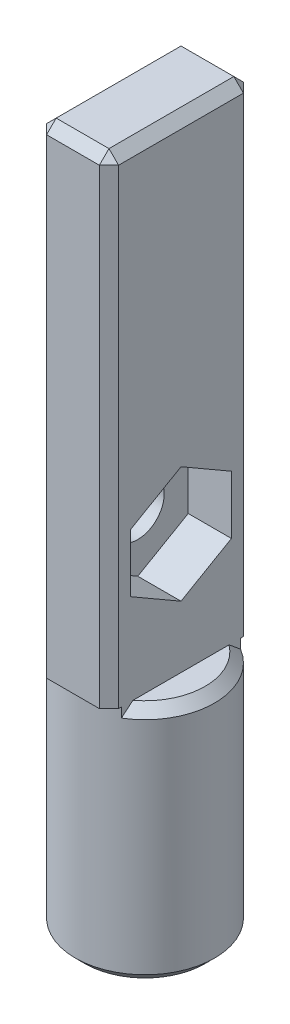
ISO-10303-21;
HEADER;
FILE_DESCRIPTION(('STEP AP214'),'2;1');
FILE_NAME('part.step','',(''),(''),'','','');
FILE_SCHEMA(('AUTOMOTIVE_DESIGN { 1 0 10303 214 1 1 1 1 }'));
ENDSEC;
DATA;
#1=APPLICATION_CONTEXT('core data for automotive mechanical design processes');
#2=APPLICATION_PROTOCOL_DEFINITION('international standard','automotive_design',2000,#1);
#3=PRODUCT_CONTEXT('',#1,'mechanical');
#4=PRODUCT('Part','Part','',(#3));
#5=PRODUCT_RELATED_PRODUCT_CATEGORY('part','',(#4));
#6=PRODUCT_DEFINITION_FORMATION('','',#4);
#7=PRODUCT_DEFINITION_CONTEXT('part definition',#1,'design');
#8=PRODUCT_DEFINITION('design','',#6,#7);
#9=PRODUCT_DEFINITION_SHAPE('','',#8);
#10=(LENGTH_UNIT() NAMED_UNIT(*) SI_UNIT(.MILLI.,.METRE.));
#11=(NAMED_UNIT(*) PLANE_ANGLE_UNIT() SI_UNIT($,.RADIAN.));
#12=(NAMED_UNIT(*) SI_UNIT($,.STERADIAN.) SOLID_ANGLE_UNIT());
#13=UNCERTAINTY_MEASURE_WITH_UNIT(LENGTH_MEASURE(1.E-05),#10,'distance_accuracy_value','');
#14=(GEOMETRIC_REPRESENTATION_CONTEXT(3) GLOBAL_UNCERTAINTY_ASSIGNED_CONTEXT((#13)) GLOBAL_UNIT_ASSIGNED_CONTEXT((#10,
#11,#12)) REPRESENTATION_CONTEXT('',''));
#15=CARTESIAN_POINT('',(0.,0.,0.));
#16=DIRECTION('',(0.,0.,1.));
#17=DIRECTION('',(1.,0.,0.));
#18=AXIS2_PLACEMENT_3D('',#15,#16,#17);
#19=CARTESIAN_POINT('',(0.,10.,0.));
#20=DIRECTION('',(0.,1.,0.));
#21=DIRECTION('',(0.,0.,1.));
#22=AXIS2_PLACEMENT_3D('',#19,#20,#21);
#23=PLANE('',#22);
#24=DIRECTION('',(0.,0.,1.));
#25=VECTOR('',#24,1.);
#26=CARTESIAN_POINT('',(-1.5,10.,3.));
#27=LINE('',#26,#25);
#28=CARTESIAN_POINT('',(-1.5,10.,-2.00000000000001));
#29=VERTEX_POINT('',#28);
#30=CARTESIAN_POINT('',(-1.5,10.,2.00000000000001));
#31=VERTEX_POINT('',#30);
#32=EDGE_CURVE('E283',#29,#31,#27,.T.);
#33=ORIENTED_EDGE('',*,*,#32,.F.);
#34=CARTESIAN_POINT('',(0.,10.,0.));
#35=DIRECTION('',(0.,1.,0.));
#36=DIRECTION('',(0.,0.,1.));
#37=AXIS2_PLACEMENT_3D('',#34,#35,#36);
#38=CIRCLE('',#37,2.50000000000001);
#39=EDGE_CURVE('E448',#29,#31,#38,.T.);
#40=ORIENTED_EDGE('',*,*,#39,.T.);
#41=EDGE_LOOP('',(#33,#40));
#42=FACE_BOUND('',#41,.T.);
#43=ADVANCED_FACE('F41',(#42),#23,.T.);
#44=CARTESIAN_POINT('',(0.,10.,0.));
#45=DIRECTION('',(0.,-1.,0.));
#46=DIRECTION('',(0.,0.,-1.));
#47=AXIS2_PLACEMENT_3D('',#44,#45,#46);
#48=CYLINDRICAL_SURFACE('',#47,2.9);
#49=CARTESIAN_POINT('',(0.,0.400000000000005,0.));
#50=DIRECTION('',(0.,1.,0.));
#51=DIRECTION('',(0.,0.,1.));
#52=AXIS2_PLACEMENT_3D('',#49,#50,#51);
#53=CIRCLE('',#52,2.9);
#54=CARTESIAN_POINT('',(0.,0.400000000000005,2.9));
#55=VERTEX_POINT('',#54);
#56=EDGE_CURVE('E426',#55,#55,#53,.T.);
#57=ORIENTED_EDGE('',*,*,#56,.T.);
#58=EDGE_LOOP('',(#57));
#59=FACE_BOUND('',#58,.T.);
#60=CARTESIAN_POINT('',(0.,10.,0.));
#61=DIRECTION('',(0.,1.,0.));
#62=DIRECTION('',(0.,0.,1.));
#63=AXIS2_PLACEMENT_3D('',#60,#61,#62);
#64=CIRCLE('',#63,2.9);
#65=CARTESIAN_POINT('',(1.5,10.,-2.48193472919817));
#66=VERTEX_POINT('',#65);
#67=CARTESIAN_POINT('',(-1.5,10.,-2.48193472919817));
#68=VERTEX_POINT('',#67);
#69=EDGE_CURVE('E309',#66,#68,#64,.T.);
#70=ORIENTED_EDGE('',*,*,#69,.F.);
#71=DIRECTION('',(0.,-1.,0.));
#72=VECTOR('',#71,1.);
#73=CARTESIAN_POINT('',(1.5,10.,-2.48193472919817));
#74=LINE('',#73,#72);
#75=CARTESIAN_POINT('',(1.5,9.60000000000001,-2.48193472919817));
#76=VERTEX_POINT('',#75);
#77=EDGE_CURVE('E71',#66,#76,#74,.T.);
#78=ORIENTED_EDGE('',*,*,#77,.T.);
#79=CARTESIAN_POINT('',(0.,9.60000000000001,0.));
#80=DIRECTION('',(0.,1.,0.));
#81=DIRECTION('',(0.,0.,1.));
#82=AXIS2_PLACEMENT_3D('',#79,#80,#81);
#83=CIRCLE('',#82,2.9);
#84=CARTESIAN_POINT('',(1.5,9.60000000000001,2.48193472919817));
#85=VERTEX_POINT('',#84);
#86=EDGE_CURVE('E442',#76,#85,#83,.F.);
#87=ORIENTED_EDGE('',*,*,#86,.T.);
#88=DIRECTION('',(0.,-1.,0.));
#89=VECTOR('',#88,1.);
#90=CARTESIAN_POINT('',(1.5,9.60000000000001,2.48193472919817));
#91=LINE('',#90,#89);
#92=CARTESIAN_POINT('',(1.5,10.,2.48193472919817));
#93=VERTEX_POINT('',#92);
#94=EDGE_CURVE('E439',#85,#93,#91,.F.);
#95=ORIENTED_EDGE('',*,*,#94,.T.);
#96=CARTESIAN_POINT('',(-1.5,10.,2.48193472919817));
#97=VERTEX_POINT('',#96);
#98=EDGE_CURVE('E302',#97,#93,#64,.T.);
#99=ORIENTED_EDGE('',*,*,#98,.F.);
#100=DIRECTION('',(0.,-1.,0.));
#101=VECTOR('',#100,1.);
#102=CARTESIAN_POINT('',(-1.5,10.,2.48193472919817));
#103=LINE('',#102,#101);
#104=CARTESIAN_POINT('',(-1.5,9.60000000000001,2.48193472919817));
#105=VERTEX_POINT('',#104);
#106=EDGE_CURVE('E63',#97,#105,#103,.T.);
#107=ORIENTED_EDGE('',*,*,#106,.T.);
#108=CARTESIAN_POINT('',(0.,9.60000000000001,0.));
#109=DIRECTION('',(0.,1.,0.));
#110=DIRECTION('',(0.,0.,1.));
#111=AXIS2_PLACEMENT_3D('',#108,#109,#110);
#112=CIRCLE('',#111,2.9);
#113=CARTESIAN_POINT('',(-1.5,9.60000000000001,-2.48193472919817));
#114=VERTEX_POINT('',#113);
#115=EDGE_CURVE('E433',#105,#114,#112,.F.);
#116=ORIENTED_EDGE('',*,*,#115,.T.);
#117=DIRECTION('',(0.,-1.,0.));
#118=VECTOR('',#117,1.);
#119=CARTESIAN_POINT('',(-1.5,9.60000000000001,-2.48193472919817));
#120=LINE('',#119,#118);
#121=EDGE_CURVE('E430',#114,#68,#120,.F.);
#122=ORIENTED_EDGE('',*,*,#121,.T.);
#123=EDGE_LOOP('',(#70,#78,#87,#95,#99,#107,#116,#122));
#124=FACE_BOUND('',#123,.T.);
#125=ADVANCED_FACE('F521',(#59,#124),#48,.T.);
#126=DIRECTION('',(0.,0.,-1.));
#127=VECTOR('',#126,1.);
#128=CARTESIAN_POINT('',(1.5,10.,3.));
#129=LINE('',#128,#127);
#130=CARTESIAN_POINT('',(1.5,10.,2.00000000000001));
#131=VERTEX_POINT('',#130);
#132=CARTESIAN_POINT('',(1.5,10.,-2.00000000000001));
#133=VERTEX_POINT('',#132);
#134=EDGE_CURVE('E293',#131,#133,#129,.T.);
#135=ORIENTED_EDGE('',*,*,#134,.F.);
#136=CARTESIAN_POINT('',(0.,10.,0.));
#137=DIRECTION('',(0.,1.,0.));
#138=DIRECTION('',(0.,0.,1.));
#139=AXIS2_PLACEMENT_3D('',#136,#137,#138);
#140=CIRCLE('',#139,2.50000000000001);
#141=EDGE_CURVE('E372',#131,#133,#140,.T.);
#142=ORIENTED_EDGE('',*,*,#141,.T.);
#143=EDGE_LOOP('',(#135,#142));
#144=FACE_BOUND('',#143,.T.);
#145=ADVANCED_FACE('F518',(#144),#23,.T.);
#146=CARTESIAN_POINT('',(0.,0.,0.));
#147=DIRECTION('',(0.,1.,0.));
#148=DIRECTION('',(0.,0.,1.));
#149=AXIS2_PLACEMENT_3D('',#146,#147,#148);
#150=PLANE('',#149);
#151=CARTESIAN_POINT('',(0.,0.,0.));
#152=DIRECTION('',(0.,1.,0.));
#153=DIRECTION('',(0.,0.,1.));
#154=AXIS2_PLACEMENT_3D('',#151,#152,#153);
#155=CIRCLE('',#154,2.49999999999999);
#156=CARTESIAN_POINT('',(0.,0.,2.49999999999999));
#157=VERTEX_POINT('',#156);
#158=EDGE_CURVE('E452',#157,#157,#155,.F.);
#159=ORIENTED_EDGE('',*,*,#158,.T.);
#160=EDGE_LOOP('',(#159));
#161=FACE_BOUND('',#160,.T.);
#162=CARTESIAN_POINT('',(0.,0.,0.));
#163=DIRECTION('',(0.,-1.,0.));
#164=DIRECTION('',(0.,0.,-1.));
#165=AXIS2_PLACEMENT_3D('',#162,#163,#164);
#166=CIRCLE('',#165,2.1);
#167=CARTESIAN_POINT('',(0.,0.,-2.1));
#168=VERTEX_POINT('',#167);
#169=EDGE_CURVE('E297',#168,#168,#166,.T.);
#170=ORIENTED_EDGE('',*,*,#169,.F.);
#171=EDGE_LOOP('',(#170));
#172=FACE_BOUND('',#171,.T.);
#173=ADVANCED_FACE('F516',(#161,#172),#150,.F.);
#174=CARTESIAN_POINT('',(0.,8.,0.));
#175=DIRECTION('',(0.,-1.,0.));
#176=DIRECTION('',(0.,0.,-1.));
#177=AXIS2_PLACEMENT_3D('',#174,#175,#176);
#178=CYLINDRICAL_SURFACE('',#177,2.1);
#179=CARTESIAN_POINT('',(0.,8.,0.));
#180=DIRECTION('',(0.,-1.,0.));
#181=DIRECTION('',(0.,0.,-1.));
#182=AXIS2_PLACEMENT_3D('',#179,#180,#181);
#183=CIRCLE('',#182,2.1);
#184=CARTESIAN_POINT('',(0.,8.,-2.1));
#185=VERTEX_POINT('',#184);
#186=EDGE_CURVE('E298',#185,#185,#183,.T.);
#187=ORIENTED_EDGE('',*,*,#186,.F.);
#188=EDGE_LOOP('',(#187));
#189=FACE_BOUND('',#188,.T.);
#190=ORIENTED_EDGE('',*,*,#169,.T.);
#191=EDGE_LOOP('',(#190));
#192=FACE_BOUND('',#191,.T.);
#193=ADVANCED_FACE('F512',(#189,#192),#178,.F.);
#194=CARTESIAN_POINT('',(0.,8.,0.));
#195=DIRECTION('',(0.,-1.,0.));
#196=DIRECTION('',(0.,0.,-1.));
#197=AXIS2_PLACEMENT_3D('',#194,#195,#196);
#198=PLANE('',#197);
#199=ORIENTED_EDGE('',*,*,#186,.T.);
#200=EDGE_LOOP('',(#199));
#201=FACE_BOUND('',#200,.T.);
#202=ADVANCED_FACE('F508',(#201),#198,.T.);
#203=CARTESIAN_POINT('',(0.,10.,0.));
#204=DIRECTION('',(0.,-1.,0.));
#205=DIRECTION('',(0.,0.,-1.));
#206=AXIS2_PLACEMENT_3D('',#203,#204,#205);
#207=PLANE('',#206);
#208=DIRECTION('',(-1.,0.,0.));
#209=VECTOR('',#208,1.);
#210=CARTESIAN_POINT('',(-1.5,10.,-3.));
#211=LINE('',#210,#209);
#212=CARTESIAN_POINT('',(1.1,10.,-3.));
#213=VERTEX_POINT('',#212);
#214=CARTESIAN_POINT('',(-1.1,10.,-3.));
#215=VERTEX_POINT('',#214);
#216=EDGE_CURVE('E292',#213,#215,#211,.T.);
#217=ORIENTED_EDGE('',*,*,#216,.F.);
#218=DIRECTION('',(-0.707106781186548,0.,-0.707106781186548));
#219=VECTOR('',#218,1.);
#220=CARTESIAN_POINT('',(2.05,10.,-2.05));
#221=LINE('',#220,#219);
#222=CARTESIAN_POINT('',(1.5,10.,-2.6));
#223=VERTEX_POINT('',#222);
#224=EDGE_CURVE('E369',#213,#223,#221,.F.);
#225=ORIENTED_EDGE('',*,*,#224,.T.);
#226=EDGE_CURVE('E287',#66,#223,#129,.T.);
#227=ORIENTED_EDGE('',*,*,#226,.F.);
#228=ORIENTED_EDGE('',*,*,#69,.T.);
#229=CARTESIAN_POINT('',(-1.5,10.,-2.6));
#230=VERTEX_POINT('',#229);
#231=EDGE_CURVE('E277',#230,#68,#27,.T.);
#232=ORIENTED_EDGE('',*,*,#231,.F.);
#233=DIRECTION('',(-0.707106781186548,0.,0.707106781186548));
#234=VECTOR('',#233,1.);
#235=CARTESIAN_POINT('',(-2.05,10.,-2.05));
#236=LINE('',#235,#234);
#237=EDGE_CURVE('E366',#230,#215,#236,.F.);
#238=ORIENTED_EDGE('',*,*,#237,.T.);
#239=EDGE_LOOP('',(#217,#225,#227,#228,#232,#238));
#240=FACE_BOUND('',#239,.T.);
#241=ADVANCED_FACE('F506',(#240),#207,.T.);
#242=CARTESIAN_POINT('',(-1.5,30.,3.));
#243=DIRECTION('',(1.,0.,0.));
#244=DIRECTION('',(0.,0.,-1.));
#245=AXIS2_PLACEMENT_3D('',#242,#243,#244);
#246=PLANE('',#245);
#247=CARTESIAN_POINT('',(-1.5,15.,0.));
#248=DIRECTION('',(1.,0.,0.));
#249=DIRECTION('',(0.,0.,-1.));
#250=AXIS2_PLACEMENT_3D('',#247,#248,#249);
#251=CIRCLE('',#250,1.1);
#252=CARTESIAN_POINT('',(-1.5,15.,-1.1));
#253=VERTEX_POINT('',#252);
#254=EDGE_CURVE('E233',#253,#253,#251,.T.);
#255=ORIENTED_EDGE('',*,*,#254,.T.);
#256=EDGE_LOOP('',(#255));
#257=FACE_BOUND('',#256,.T.);
#258=CARTESIAN_POINT('',(-1.5,10.,2.6));
#259=VERTEX_POINT('',#258);
#260=EDGE_CURVE('E282',#97,#259,#27,.T.);
#261=ORIENTED_EDGE('',*,*,#260,.T.);
#262=DIRECTION('',(0.,1.,0.));
#263=VECTOR('',#262,1.);
#264=CARTESIAN_POINT('',(-1.5,30.,2.6));
#265=LINE('',#264,#263);
#266=CARTESIAN_POINT('',(-1.5,29.6,2.6));
#267=VERTEX_POINT('',#266);
#268=EDGE_CURVE('E341',#259,#267,#265,.T.);
#269=ORIENTED_EDGE('',*,*,#268,.T.);
#270=DIRECTION('',(0.,0.,-1.));
#271=VECTOR('',#270,1.);
#272=CARTESIAN_POINT('',(-1.5,29.6,3.));
#273=LINE('',#272,#271);
#274=CARTESIAN_POINT('',(-1.5,29.6,-2.6));
#275=VERTEX_POINT('',#274);
#276=EDGE_CURVE('E338',#267,#275,#273,.T.);
#277=ORIENTED_EDGE('',*,*,#276,.T.);
#278=DIRECTION('',(0.,-1.,0.));
#279=VECTOR('',#278,1.);
#280=CARTESIAN_POINT('',(-1.5,30.,-2.6));
#281=LINE('',#280,#279);
#282=EDGE_CURVE('E335',#275,#230,#281,.T.);
#283=ORIENTED_EDGE('',*,*,#282,.T.);
#284=ORIENTED_EDGE('',*,*,#231,.T.);
#285=ORIENTED_EDGE('',*,*,#121,.F.);
#286=CARTESIAN_POINT('',(-1.5,9.60000000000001,-2.48193472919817));
#287=CARTESIAN_POINT('',(-1.5,9.63393784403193,-2.4422783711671));
#288=CARTESIAN_POINT('',(-1.5,9.66775216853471,-2.40251586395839));
#289=CARTESIAN_POINT('',(-1.5,9.73509198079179,-2.32275170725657));
#290=CARTESIAN_POINT('',(-1.5,9.76861748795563,-2.28275007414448));
#291=CARTESIAN_POINT('',(-1.5,9.83534295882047,-2.20247487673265));
#292=CARTESIAN_POINT('',(-1.5,9.86854291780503,-2.16220130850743));
#293=CARTESIAN_POINT('',(-1.5,9.93456697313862,-2.08134282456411));
#294=CARTESIAN_POINT('',(-1.5,9.96739104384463,-2.0407578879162));
#295=CARTESIAN_POINT('',(-1.5,10.0000000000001,-2.00000000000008));
#296=B_SPLINE_CURVE_WITH_KNOTS('',3,(#286,#287,#288,#289,#290,#291,#292,#293,#294,#295),
.UNSPECIFIED.,.F.,.F.,(4,2,2,2,4),(0.,0.156587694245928,0.313164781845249,0.469744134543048,
0.626334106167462),.UNSPECIFIED.);
#297=EDGE_CURVE('E11',#114,#29,#296,.T.);
#298=ORIENTED_EDGE('',*,*,#297,.T.);
#299=ORIENTED_EDGE('',*,*,#32,.T.);
#300=CARTESIAN_POINT('',(-1.5,10.,2.00000000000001));
#301=CARTESIAN_POINT('',(-1.5,9.9673910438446,2.04075788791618));
#302=CARTESIAN_POINT('',(-1.5,9.93456697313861,2.0813428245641));
#303=CARTESIAN_POINT('',(-1.5,9.86854291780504,2.16220130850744));
#304=CARTESIAN_POINT('',(-1.5,9.83534295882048,2.20247487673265));
#305=CARTESIAN_POINT('',(-1.5,9.76861748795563,2.28275007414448));
#306=CARTESIAN_POINT('',(-1.5,9.73509198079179,2.32275170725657));
#307=CARTESIAN_POINT('',(-1.5,9.66775216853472,2.40251586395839));
#308=CARTESIAN_POINT('',(-1.5,9.63393784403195,2.44227837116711));
#309=CARTESIAN_POINT('',(-1.5,9.60000000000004,2.4819347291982));
#310=B_SPLINE_CURVE_WITH_KNOTS('',3,(#300,#301,#302,#303,#304,#305,#306,#307,#308,#309),
.UNSPECIFIED.,.F.,.F.,(4,2,2,2,4),(0.,0.156589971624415,0.313169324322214,0.469746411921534,
0.626334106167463),.UNSPECIFIED.);
#311=EDGE_CURVE('E56',#31,#105,#310,.T.);
#312=ORIENTED_EDGE('',*,*,#311,.T.);
#313=ORIENTED_EDGE('',*,*,#106,.F.);
#314=EDGE_LOOP('',(#261,#269,#277,#283,#284,#285,#298,#299,#312,#313));
#315=FACE_BOUND('',#314,.T.);
#316=ADVANCED_FACE('F501',(#257,#315),#246,.F.);
#317=CARTESIAN_POINT('',(-1.5,30.,3.));
#318=DIRECTION('',(0.,0.,-1.));
#319=DIRECTION('',(-1.,0.,0.));
#320=AXIS2_PLACEMENT_3D('',#317,#318,#319);
#321=PLANE('',#320);
#322=DIRECTION('',(1.,0.,0.));
#323=VECTOR('',#322,1.);
#324=CARTESIAN_POINT('',(-1.5,10.,3.));
#325=LINE('',#324,#323);
#326=CARTESIAN_POINT('',(-1.1,10.,3.));
#327=VERTEX_POINT('',#326);
#328=CARTESIAN_POINT('',(1.1,10.,3.));
#329=VERTEX_POINT('',#328);
#330=EDGE_CURVE('E281',#327,#329,#325,.T.);
#331=ORIENTED_EDGE('',*,*,#330,.T.);
#332=DIRECTION('',(0.,1.,0.));
#333=VECTOR('',#332,1.);
#334=CARTESIAN_POINT('',(1.1,30.,3.));
#335=LINE('',#334,#333);
#336=CARTESIAN_POINT('',(1.1,29.6,3.));
#337=VERTEX_POINT('',#336);
#338=EDGE_CURVE('E332',#329,#337,#335,.T.);
#339=ORIENTED_EDGE('',*,*,#338,.T.);
#340=DIRECTION('',(-1.,0.,0.));
#341=VECTOR('',#340,1.);
#342=CARTESIAN_POINT('',(-1.5,29.6,3.));
#343=LINE('',#342,#341);
#344=CARTESIAN_POINT('',(-1.1,29.6,3.));
#345=VERTEX_POINT('',#344);
#346=EDGE_CURVE('E326',#337,#345,#343,.T.);
#347=ORIENTED_EDGE('',*,*,#346,.T.);
#348=DIRECTION('',(0.,-1.,0.));
#349=VECTOR('',#348,1.);
#350=CARTESIAN_POINT('',(-1.1,30.,3.));
#351=LINE('',#350,#349);
#352=EDGE_CURVE('E329',#345,#327,#351,.T.);
#353=ORIENTED_EDGE('',*,*,#352,.T.);
#354=EDGE_LOOP('',(#331,#339,#347,#353));
#355=FACE_BOUND('',#354,.T.);
#356=ADVANCED_FACE('F505',(#355),#321,.F.);
#357=CARTESIAN_POINT('',(1.5,30.,3.));
#358=DIRECTION('',(-1.,0.,0.));
#359=DIRECTION('',(0.,0.,1.));
#360=AXIS2_PLACEMENT_3D('',#357,#358,#359);
#361=PLANE('',#360);
#362=DIRECTION('',(0.,0.500000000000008,-0.866025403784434));
#363=VECTOR('',#362,1.);
#364=CARTESIAN_POINT('',(1.5,13.7875644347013,-2.10000000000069));
#365=LINE('',#364,#363);
#366=CARTESIAN_POINT('',(1.5,12.5751288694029,-2.70616862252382E-13));
#367=VERTEX_POINT('',#366);
#368=CARTESIAN_POINT('',(1.5,13.7875644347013,-2.10000000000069));
#369=VERTEX_POINT('',#368);
#370=EDGE_CURVE('E248',#367,#369,#365,.T.);
#371=ORIENTED_EDGE('',*,*,#370,.F.);
#372=DIRECTION('',(0.,-0.500000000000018,-0.866025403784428));
#373=VECTOR('',#372,1.);
#374=CARTESIAN_POINT('',(1.5,12.5751288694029,-2.70074761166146E-13));
#375=LINE('',#374,#373);
#376=CARTESIAN_POINT('',(1.5,13.7875644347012,2.0999999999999));
#377=VERTEX_POINT('',#376);
#378=EDGE_CURVE('E205',#377,#367,#375,.T.);
#379=ORIENTED_EDGE('',*,*,#378,.F.);
#380=DIRECTION('',(0.,-1.,0.));
#381=VECTOR('',#380,1.);
#382=CARTESIAN_POINT('',(1.5,13.7875644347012,2.0999999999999));
#383=LINE('',#382,#381);
#384=CARTESIAN_POINT('',(1.5,16.2124355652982,2.10000000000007));
#385=VERTEX_POINT('',#384);
#386=EDGE_CURVE('E226',#385,#377,#383,.T.);
#387=ORIENTED_EDGE('',*,*,#386,.F.);
#388=DIRECTION('',(0.,-0.499999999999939,0.866025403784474));
#389=VECTOR('',#388,1.);
#390=CARTESIAN_POINT('',(1.5,16.2124355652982,2.10000000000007));
#391=LINE('',#390,#389);
#392=CARTESIAN_POINT('',(1.5,17.4248711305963,0.));
#393=VERTEX_POINT('',#392);
#394=EDGE_CURVE('E230',#393,#385,#391,.T.);
#395=ORIENTED_EDGE('',*,*,#394,.F.);
#396=DIRECTION('',(0.,0.5,0.866025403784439));
#397=VECTOR('',#396,1.);
#398=CARTESIAN_POINT('',(1.5,17.4248711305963,0.));
#399=LINE('',#398,#397);
#400=CARTESIAN_POINT('',(1.5,16.2124355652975,-2.10000000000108));
#401=VERTEX_POINT('',#400);
#402=EDGE_CURVE('E255',#401,#393,#399,.T.);
#403=ORIENTED_EDGE('',*,*,#402,.F.);
#404=DIRECTION('',(0.,1.,-1.63108442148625E-13));
#405=VECTOR('',#404,1.);
#406=CARTESIAN_POINT('',(1.5,16.2124355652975,-2.10000000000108));
#407=LINE('',#406,#405);
#408=EDGE_CURVE('E251',#369,#401,#407,.T.);
#409=ORIENTED_EDGE('',*,*,#408,.F.);
#410=EDGE_LOOP('',(#371,#379,#387,#395,#403,#409));
#411=FACE_BOUND('',#410,.T.);
#412=DIRECTION('',(0.,0.,1.));
#413=VECTOR('',#412,1.);
#414=CARTESIAN_POINT('',(1.5,29.6,3.));
#415=LINE('',#414,#413);
#416=CARTESIAN_POINT('',(1.5,29.6,-2.6));
#417=VERTEX_POINT('',#416);
#418=CARTESIAN_POINT('',(1.5,29.6,2.6));
#419=VERTEX_POINT('',#418);
#420=EDGE_CURVE('E313',#417,#419,#415,.T.);
#421=ORIENTED_EDGE('',*,*,#420,.T.);
#422=DIRECTION('',(0.,-1.,0.));
#423=VECTOR('',#422,1.);
#424=CARTESIAN_POINT('',(1.5,30.,2.6));
#425=LINE('',#424,#423);
#426=CARTESIAN_POINT('',(1.5,10.,2.6));
#427=VERTEX_POINT('',#426);
#428=EDGE_CURVE('E316',#419,#427,#425,.T.);
#429=ORIENTED_EDGE('',*,*,#428,.T.);
#430=EDGE_CURVE('E288',#427,#93,#129,.T.);
#431=ORIENTED_EDGE('',*,*,#430,.T.);
#432=ORIENTED_EDGE('',*,*,#94,.F.);
#433=CARTESIAN_POINT('',(1.5,9.60000000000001,2.48193472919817));
#434=CARTESIAN_POINT('',(1.5,9.63393784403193,2.4422783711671));
#435=CARTESIAN_POINT('',(1.5,9.66775216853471,2.40251586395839));
#436=CARTESIAN_POINT('',(1.5,9.73509198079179,2.32275170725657));
#437=CARTESIAN_POINT('',(1.5,9.76861748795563,2.28275007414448));
#438=CARTESIAN_POINT('',(1.5,9.83534295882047,2.20247487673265));
#439=CARTESIAN_POINT('',(1.5,9.86854291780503,2.16220130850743));
#440=CARTESIAN_POINT('',(1.5,9.93456697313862,2.0813428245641));
#441=CARTESIAN_POINT('',(1.5,9.96739104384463,2.0407578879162));
#442=CARTESIAN_POINT('',(1.5,10.0000000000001,2.00000000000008));
#443=B_SPLINE_CURVE_WITH_KNOTS('',3,(#433,#434,#435,#436,#437,#438,#439,#440,#441,#442),
.UNSPECIFIED.,.F.,.F.,(4,2,2,2,4),(0.,0.156587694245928,0.31316478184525,0.469744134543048,
0.626334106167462),.UNSPECIFIED.);
#444=EDGE_CURVE('E465',#85,#131,#443,.T.);
#445=ORIENTED_EDGE('',*,*,#444,.T.);
#446=ORIENTED_EDGE('',*,*,#134,.T.);
#447=CARTESIAN_POINT('',(1.5,10.,-2.00000000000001));
#448=CARTESIAN_POINT('',(1.5,9.9673910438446,-2.04075788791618));
#449=CARTESIAN_POINT('',(1.5,9.93456697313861,-2.0813428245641));
#450=CARTESIAN_POINT('',(1.5,9.86854291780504,-2.16220130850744));
#451=CARTESIAN_POINT('',(1.5,9.83534295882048,-2.20247487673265));
#452=CARTESIAN_POINT('',(1.5,9.76861748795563,-2.28275007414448));
#453=CARTESIAN_POINT('',(1.5,9.73509198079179,-2.32275170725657));
#454=CARTESIAN_POINT('',(1.5,9.66775216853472,-2.40251586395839));
#455=CARTESIAN_POINT('',(1.5,9.63393784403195,-2.44227837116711));
#456=CARTESIAN_POINT('',(1.5,9.60000000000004,-2.4819347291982));
#457=B_SPLINE_CURVE_WITH_KNOTS('',3,(#447,#448,#449,#450,#451,#452,#453,#454,#455,#456),
.UNSPECIFIED.,.F.,.F.,(4,2,2,2,4),(0.,0.156589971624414,0.313169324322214,0.469746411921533,
0.626334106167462),.UNSPECIFIED.);
#458=EDGE_CURVE('E456',#133,#76,#457,.T.);
#459=ORIENTED_EDGE('',*,*,#458,.T.);
#460=ORIENTED_EDGE('',*,*,#77,.F.);
#461=ORIENTED_EDGE('',*,*,#226,.T.);
#462=DIRECTION('',(0.,1.,0.));
#463=VECTOR('',#462,1.);
#464=CARTESIAN_POINT('',(1.5,30.,-2.6));
#465=LINE('',#464,#463);
#466=EDGE_CURVE('E310',#223,#417,#465,.T.);
#467=ORIENTED_EDGE('',*,*,#466,.T.);
#468=EDGE_LOOP('',(#421,#429,#431,#432,#445,#446,#459,#460,#461,#467));
#469=FACE_BOUND('',#468,.T.);
#470=ADVANCED_FACE('F470',(#411,#469),#361,.F.);
#471=CARTESIAN_POINT('',(-1.5,30.,-3.));
#472=DIRECTION('',(0.,0.,1.));
#473=DIRECTION('',(1.,0.,0.));
#474=AXIS2_PLACEMENT_3D('',#471,#472,#473);
#475=PLANE('',#474);
#476=DIRECTION('',(1.,0.,0.));
#477=VECTOR('',#476,1.);
#478=CARTESIAN_POINT('',(-1.5,29.6,-3.));
#479=LINE('',#478,#477);
#480=CARTESIAN_POINT('',(-1.1,29.6,-3.));
#481=VERTEX_POINT('',#480);
#482=CARTESIAN_POINT('',(1.1,29.6,-3.));
#483=VERTEX_POINT('',#482);
#484=EDGE_CURVE('E360',#481,#483,#479,.T.);
#485=ORIENTED_EDGE('',*,*,#484,.T.);
#486=DIRECTION('',(0.,-1.,0.));
#487=VECTOR('',#486,1.);
#488=CARTESIAN_POINT('',(1.1,30.,-3.));
#489=LINE('',#488,#487);
#490=EDGE_CURVE('E363',#483,#213,#489,.T.);
#491=ORIENTED_EDGE('',*,*,#490,.T.);
#492=ORIENTED_EDGE('',*,*,#216,.T.);
#493=DIRECTION('',(0.,1.,0.));
#494=VECTOR('',#493,1.);
#495=CARTESIAN_POINT('',(-1.1,30.,-3.));
#496=LINE('',#495,#494);
#497=EDGE_CURVE('E357',#215,#481,#496,.T.);
#498=ORIENTED_EDGE('',*,*,#497,.T.);
#499=EDGE_LOOP('',(#485,#491,#492,#498));
#500=FACE_BOUND('',#499,.T.);
#501=ADVANCED_FACE('F673',(#500),#475,.F.);
#502=CARTESIAN_POINT('',(0.,30.,0.));
#503=DIRECTION('',(0.,-1.,0.));
#504=DIRECTION('',(0.,0.,-1.));
#505=AXIS2_PLACEMENT_3D('',#502,#503,#504);
#506=PLANE('',#505);
#507=DIRECTION('',(0.,0.,1.));
#508=VECTOR('',#507,1.);
#509=CARTESIAN_POINT('',(-1.1,30.,0.));
#510=LINE('',#509,#508);
#511=CARTESIAN_POINT('',(-1.1,30.,-2.6));
#512=VERTEX_POINT('',#511);
#513=CARTESIAN_POINT('',(-1.1,30.,2.6));
#514=VERTEX_POINT('',#513);
#515=EDGE_CURVE('E344',#512,#514,#510,.T.);
#516=ORIENTED_EDGE('',*,*,#515,.T.);
#517=DIRECTION('',(1.,0.,0.));
#518=VECTOR('',#517,1.);
#519=CARTESIAN_POINT('',(0.,30.,2.6));
#520=LINE('',#519,#518);
#521=CARTESIAN_POINT('',(1.1,30.,2.6));
#522=VERTEX_POINT('',#521);
#523=EDGE_CURVE('E353',#514,#522,#520,.T.);
#524=ORIENTED_EDGE('',*,*,#523,.T.);
#525=DIRECTION('',(0.,0.,-1.));
#526=VECTOR('',#525,1.);
#527=CARTESIAN_POINT('',(1.1,30.,0.));
#528=LINE('',#527,#526);
#529=CARTESIAN_POINT('',(1.1,30.,-2.6));
#530=VERTEX_POINT('',#529);
#531=EDGE_CURVE('E350',#522,#530,#528,.T.);
#532=ORIENTED_EDGE('',*,*,#531,.T.);
#533=DIRECTION('',(-1.,0.,0.));
#534=VECTOR('',#533,1.);
#535=CARTESIAN_POINT('',(0.,30.,-2.6));
#536=LINE('',#535,#534);
#537=EDGE_CURVE('E347',#530,#512,#536,.T.);
#538=ORIENTED_EDGE('',*,*,#537,.T.);
#539=EDGE_LOOP('',(#516,#524,#532,#538));
#540=FACE_BOUND('',#539,.T.);
#541=ADVANCED_FACE('F660',(#540),#506,.F.);
#542=ORIENTED_EDGE('',*,*,#430,.F.);
#543=DIRECTION('',(0.707106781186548,0.,-0.707106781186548));
#544=VECTOR('',#543,1.);
#545=CARTESIAN_POINT('',(2.05,10.,2.05));
#546=LINE('',#545,#544);
#547=EDGE_CURVE('E323',#427,#329,#546,.F.);
#548=ORIENTED_EDGE('',*,*,#547,.T.);
#549=ORIENTED_EDGE('',*,*,#330,.F.);
#550=DIRECTION('',(0.707106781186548,0.,0.707106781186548));
#551=VECTOR('',#550,1.);
#552=CARTESIAN_POINT('',(-2.05,10.,2.05));
#553=LINE('',#552,#551);
#554=EDGE_CURVE('E320',#327,#259,#553,.F.);
#555=ORIENTED_EDGE('',*,*,#554,.T.);
#556=ORIENTED_EDGE('',*,*,#260,.F.);
#557=ORIENTED_EDGE('',*,*,#98,.T.);
#558=EDGE_LOOP('',(#542,#548,#549,#555,#556,#557));
#559=FACE_BOUND('',#558,.T.);
#560=ADVANCED_FACE('F606',(#559),#207,.T.);
#561=CARTESIAN_POINT('',(-1.5,30.,-2.6));
#562=DIRECTION('',(0.707106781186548,0.,0.707106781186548));
#563=DIRECTION('',(0.,-1.,0.));
#564=AXIS2_PLACEMENT_3D('',#561,#562,#563);
#565=PLANE('',#564);
#566=DIRECTION('',(0.707106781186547,0.,-0.707106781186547));
#567=VECTOR('',#566,1.);
#568=CARTESIAN_POINT('',(-1.3,29.6,-2.8));
#569=LINE('',#568,#567);
#570=EDGE_CURVE('E415',#481,#275,#569,.F.);
#571=ORIENTED_EDGE('',*,*,#570,.F.);
#572=ORIENTED_EDGE('',*,*,#497,.F.);
#573=ORIENTED_EDGE('',*,*,#237,.F.);
#574=ORIENTED_EDGE('',*,*,#282,.F.);
#575=EDGE_LOOP('',(#571,#572,#573,#574));
#576=FACE_BOUND('',#575,.T.);
#577=ADVANCED_FACE('F487',(#576),#565,.F.);
#578=CARTESIAN_POINT('',(-1.1,30.,-2.6));
#579=DIRECTION('',(-0.577350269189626,0.577350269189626,-0.577350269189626));
#580=DIRECTION('',(-0.707106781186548,0.,0.707106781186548));
#581=AXIS2_PLACEMENT_3D('',#578,#579,#580);
#582=PLANE('',#581);
#583=DIRECTION('',(0.,0.707106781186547,0.707106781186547));
#584=VECTOR('',#583,1.);
#585=CARTESIAN_POINT('',(-1.1,30.,-2.6));
#586=LINE('',#585,#584);
#587=EDGE_CURVE('E407',#481,#512,#586,.T.);
#588=ORIENTED_EDGE('',*,*,#587,.F.);
#589=ORIENTED_EDGE('',*,*,#570,.T.);
#590=DIRECTION('',(-0.707106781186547,-0.707106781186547,0.));
#591=VECTOR('',#590,1.);
#592=CARTESIAN_POINT('',(-1.1,30.,-2.6));
#593=LINE('',#592,#591);
#594=EDGE_CURVE('E411',#512,#275,#593,.T.);
#595=ORIENTED_EDGE('',*,*,#594,.F.);
#596=EDGE_LOOP('',(#588,#589,#595));
#597=FACE_BOUND('',#596,.T.);
#598=ADVANCED_FACE('F597',(#597),#582,.T.);
#599=CARTESIAN_POINT('',(-1.1,30.,3.));
#600=DIRECTION('',(0.707106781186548,0.,-0.707106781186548));
#601=DIRECTION('',(0.,-1.,0.));
#602=AXIS2_PLACEMENT_3D('',#599,#600,#601);
#603=PLANE('',#602);
#604=ORIENTED_EDGE('',*,*,#554,.F.);
#605=ORIENTED_EDGE('',*,*,#352,.F.);
#606=DIRECTION('',(-0.707106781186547,0.,-0.707106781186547));
#607=VECTOR('',#606,1.);
#608=CARTESIAN_POINT('',(-1.5,29.6,2.6));
#609=LINE('',#608,#607);
#610=EDGE_CURVE('E403',#267,#345,#609,.F.);
#611=ORIENTED_EDGE('',*,*,#610,.F.);
#612=ORIENTED_EDGE('',*,*,#268,.F.);
#613=EDGE_LOOP('',(#604,#605,#611,#612));
#614=FACE_BOUND('',#613,.T.);
#615=ADVANCED_FACE('F591',(#614),#603,.F.);
#616=CARTESIAN_POINT('',(-1.1,30.,0.));
#617=DIRECTION('',(0.707106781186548,-0.707106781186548,0.));
#618=DIRECTION('',(0.,0.,1.));
#619=AXIS2_PLACEMENT_3D('',#616,#617,#618);
#620=PLANE('',#619);
#621=ORIENTED_EDGE('',*,*,#594,.T.);
#622=ORIENTED_EDGE('',*,*,#276,.F.);
#623=DIRECTION('',(0.707106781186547,0.707106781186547,0.));
#624=VECTOR('',#623,1.);
#625=CARTESIAN_POINT('',(-1.5,29.6,2.6));
#626=LINE('',#625,#624);
#627=EDGE_CURVE('E399',#514,#267,#626,.F.);
#628=ORIENTED_EDGE('',*,*,#627,.F.);
#629=ORIENTED_EDGE('',*,*,#515,.F.);
#630=EDGE_LOOP('',(#621,#622,#628,#629));
#631=FACE_BOUND('',#630,.T.);
#632=ADVANCED_FACE('F584',(#631),#620,.F.);
#633=CARTESIAN_POINT('',(0.,30.,-2.6));
#634=DIRECTION('',(0.,-0.707106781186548,0.707106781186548));
#635=DIRECTION('',(-1.,0.,0.));
#636=AXIS2_PLACEMENT_3D('',#633,#634,#635);
#637=PLANE('',#636);
#638=ORIENTED_EDGE('',*,*,#587,.T.);
#639=ORIENTED_EDGE('',*,*,#537,.F.);
#640=DIRECTION('',(0.,-0.707106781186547,-0.707106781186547));
#641=VECTOR('',#640,1.);
#642=CARTESIAN_POINT('',(1.1,30.,-2.6));
#643=LINE('',#642,#641);
#644=EDGE_CURVE('E395',#483,#530,#643,.F.);
#645=ORIENTED_EDGE('',*,*,#644,.F.);
#646=ORIENTED_EDGE('',*,*,#484,.F.);
#647=EDGE_LOOP('',(#638,#639,#645,#646));
#648=FACE_BOUND('',#647,.T.);
#649=ADVANCED_FACE('F577',(#648),#637,.F.);
#650=CARTESIAN_POINT('',(1.1,30.,-3.));
#651=DIRECTION('',(-0.707106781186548,0.,0.707106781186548));
#652=DIRECTION('',(0.,-1.,0.));
#653=AXIS2_PLACEMENT_3D('',#650,#651,#652);
#654=PLANE('',#653);
#655=ORIENTED_EDGE('',*,*,#224,.F.);
#656=ORIENTED_EDGE('',*,*,#490,.F.);
#657=DIRECTION('',(0.707106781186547,0.,0.707106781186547));
#658=VECTOR('',#657,1.);
#659=CARTESIAN_POINT('',(1.3,29.6,-2.8));
#660=LINE('',#659,#658);
#661=EDGE_CURVE('E391',#417,#483,#660,.F.);
#662=ORIENTED_EDGE('',*,*,#661,.F.);
#663=ORIENTED_EDGE('',*,*,#466,.F.);
#664=EDGE_LOOP('',(#655,#656,#662,#663));
#665=FACE_BOUND('',#664,.T.);
#666=ADVANCED_FACE('F570',(#665),#654,.F.);
#667=CARTESIAN_POINT('',(-1.5,29.6,2.6));
#668=DIRECTION('',(-0.577350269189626,0.577350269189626,0.577350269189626));
#669=DIRECTION('',(0.707106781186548,0.,0.707106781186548));
#670=AXIS2_PLACEMENT_3D('',#667,#668,#669);
#671=PLANE('',#670);
#672=ORIENTED_EDGE('',*,*,#627,.T.);
#673=ORIENTED_EDGE('',*,*,#610,.T.);
#674=DIRECTION('',(0.,-0.707106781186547,0.707106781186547));
#675=VECTOR('',#674,1.);
#676=CARTESIAN_POINT('',(-1.1,29.8,2.8));
#677=LINE('',#676,#675);
#678=EDGE_CURVE('E387',#514,#345,#677,.T.);
#679=ORIENTED_EDGE('',*,*,#678,.F.);
#680=EDGE_LOOP('',(#672,#673,#679));
#681=FACE_BOUND('',#680,.T.);
#682=ADVANCED_FACE('F563',(#681),#671,.T.);
#683=CARTESIAN_POINT('',(1.1,30.,-2.6));
#684=DIRECTION('',(0.577350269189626,0.577350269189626,-0.577350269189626));
#685=DIRECTION('',(-0.707106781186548,0.,-0.707106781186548));
#686=AXIS2_PLACEMENT_3D('',#683,#684,#685);
#687=PLANE('',#686);
#688=ORIENTED_EDGE('',*,*,#661,.T.);
#689=ORIENTED_EDGE('',*,*,#644,.T.);
#690=DIRECTION('',(-0.707106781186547,0.707106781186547,0.));
#691=VECTOR('',#690,1.);
#692=CARTESIAN_POINT('',(1.1,30.,-2.6));
#693=LINE('',#692,#691);
#694=EDGE_CURVE('E383',#417,#530,#693,.T.);
#695=ORIENTED_EDGE('',*,*,#694,.F.);
#696=EDGE_LOOP('',(#688,#689,#695));
#697=FACE_BOUND('',#696,.T.);
#698=ADVANCED_FACE('F556',(#697),#687,.T.);
#699=CARTESIAN_POINT('',(0.,30.,2.6));
#700=DIRECTION('',(0.,-0.707106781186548,-0.707106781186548));
#701=DIRECTION('',(1.,0.,0.));
#702=AXIS2_PLACEMENT_3D('',#699,#700,#701);
#703=PLANE('',#702);
#704=ORIENTED_EDGE('',*,*,#678,.T.);
#705=ORIENTED_EDGE('',*,*,#346,.F.);
#706=DIRECTION('',(0.,0.707106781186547,-0.707106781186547));
#707=VECTOR('',#706,1.);
#708=CARTESIAN_POINT('',(1.1,29.6,3.));
#709=LINE('',#708,#707);
#710=EDGE_CURVE('E379',#522,#337,#709,.F.);
#711=ORIENTED_EDGE('',*,*,#710,.F.);
#712=ORIENTED_EDGE('',*,*,#523,.F.);
#713=EDGE_LOOP('',(#704,#705,#711,#712));
#714=FACE_BOUND('',#713,.T.);
#715=ADVANCED_FACE('F549',(#714),#703,.F.);
#716=CARTESIAN_POINT('',(1.1,30.,0.));
#717=DIRECTION('',(-0.707106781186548,-0.707106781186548,0.));
#718=DIRECTION('',(0.,0.,-1.));
#719=AXIS2_PLACEMENT_3D('',#716,#717,#718);
#720=PLANE('',#719);
#721=ORIENTED_EDGE('',*,*,#694,.T.);
#722=ORIENTED_EDGE('',*,*,#531,.F.);
#723=DIRECTION('',(0.707106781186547,-0.707106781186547,0.));
#724=VECTOR('',#723,1.);
#725=CARTESIAN_POINT('',(1.3,29.8,2.6));
#726=LINE('',#725,#724);
#727=EDGE_CURVE('E376',#419,#522,#726,.F.);
#728=ORIENTED_EDGE('',*,*,#727,.F.);
#729=ORIENTED_EDGE('',*,*,#420,.F.);
#730=EDGE_LOOP('',(#721,#722,#728,#729));
#731=FACE_BOUND('',#730,.T.);
#732=ADVANCED_FACE('F542',(#731),#720,.F.);
#733=CARTESIAN_POINT('',(1.1,29.6,3.));
#734=DIRECTION('',(0.577350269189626,0.577350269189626,0.577350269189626));
#735=DIRECTION('',(0.707106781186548,0.,-0.707106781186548));
#736=AXIS2_PLACEMENT_3D('',#733,#734,#735);
#737=PLANE('',#736);
#738=ORIENTED_EDGE('',*,*,#727,.T.);
#739=ORIENTED_EDGE('',*,*,#710,.T.);
#740=DIRECTION('',(-0.707106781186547,0.,0.707106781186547));
#741=VECTOR('',#740,1.);
#742=CARTESIAN_POINT('',(1.1,29.6,3.));
#743=LINE('',#742,#741);
#744=EDGE_CURVE('E265',#419,#337,#743,.T.);
#745=ORIENTED_EDGE('',*,*,#744,.F.);
#746=EDGE_LOOP('',(#738,#739,#745));
#747=FACE_BOUND('',#746,.T.);
#748=ADVANCED_FACE('F535',(#747),#737,.T.);
#749=CARTESIAN_POINT('',(1.5,30.,2.6));
#750=DIRECTION('',(-0.707106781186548,0.,-0.707106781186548));
#751=DIRECTION('',(0.,-1.,0.));
#752=AXIS2_PLACEMENT_3D('',#749,#750,#751);
#753=PLANE('',#752);
#754=ORIENTED_EDGE('',*,*,#744,.T.);
#755=ORIENTED_EDGE('',*,*,#338,.F.);
#756=ORIENTED_EDGE('',*,*,#547,.F.);
#757=ORIENTED_EDGE('',*,*,#428,.F.);
#758=EDGE_LOOP('',(#754,#755,#756,#757));
#759=FACE_BOUND('',#758,.T.);
#760=ADVANCED_FACE('F529',(#759),#753,.F.);
#761=CARTESIAN_POINT('',(-0.3,12.5751288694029,-2.70074761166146E-13));
#762=DIRECTION('',(0.,-0.866025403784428,0.500000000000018));
#763=DIRECTION('',(0.,-0.500000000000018,-0.866025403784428));
#764=AXIS2_PLACEMENT_3D('',#761,#762,#763);
#765=PLANE('',#764);
#766=ORIENTED_EDGE('',*,*,#378,.T.);
#767=DIRECTION('',(1.,0.,0.));
#768=VECTOR('',#767,1.);
#769=CARTESIAN_POINT('',(-0.3,12.5751288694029,-2.70074761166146E-13));
#770=LINE('',#769,#768);
#771=CARTESIAN_POINT('',(-0.3,12.5751288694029,-2.70074761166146E-13));
#772=VERTEX_POINT('',#771);
#773=EDGE_CURVE('E198',#772,#367,#770,.T.);
#774=ORIENTED_EDGE('',*,*,#773,.F.);
#775=DIRECTION('',(0.,-0.500000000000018,-0.866025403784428));
#776=VECTOR('',#775,1.);
#777=CARTESIAN_POINT('',(-0.3,12.5751288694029,-2.70074761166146E-13));
#778=LINE('',#777,#776);
#779=CARTESIAN_POINT('',(-0.3,13.7875644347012,2.0999999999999));
#780=VERTEX_POINT('',#779);
#781=EDGE_CURVE('E202',#780,#772,#778,.T.);
#782=ORIENTED_EDGE('',*,*,#781,.F.);
#783=DIRECTION('',(1.,0.,0.));
#784=VECTOR('',#783,1.);
#785=CARTESIAN_POINT('',(-0.3,13.7875644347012,2.0999999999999));
#786=LINE('',#785,#784);
#787=EDGE_CURVE('E262',#780,#377,#786,.T.);
#788=ORIENTED_EDGE('',*,*,#787,.T.);
#789=EDGE_LOOP('',(#766,#774,#782,#788));
#790=FACE_BOUND('',#789,.T.);
#791=ADVANCED_FACE('F200',(#790),#765,.F.);
#792=CARTESIAN_POINT('',(-0.3,13.7875644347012,2.0999999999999));
#793=DIRECTION('',(0.,0.,1.));
#794=DIRECTION('',(0.,-1.,0.));
#795=AXIS2_PLACEMENT_3D('',#792,#793,#794);
#796=PLANE('',#795);
#797=ORIENTED_EDGE('',*,*,#386,.T.);
#798=ORIENTED_EDGE('',*,*,#787,.F.);
#799=DIRECTION('',(0.,-1.,0.));
#800=VECTOR('',#799,1.);
#801=CARTESIAN_POINT('',(-0.3,13.7875644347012,2.0999999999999));
#802=LINE('',#801,#800);
#803=CARTESIAN_POINT('',(-0.3,16.2124355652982,2.10000000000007));
#804=VERTEX_POINT('',#803);
#805=EDGE_CURVE('E211',#804,#780,#802,.T.);
#806=ORIENTED_EDGE('',*,*,#805,.F.);
#807=DIRECTION('',(1.,0.,0.));
#808=VECTOR('',#807,1.);
#809=CARTESIAN_POINT('',(-0.3,16.2124355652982,2.10000000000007));
#810=LINE('',#809,#808);
#811=EDGE_CURVE('E266',#804,#385,#810,.T.);
#812=ORIENTED_EDGE('',*,*,#811,.T.);
#813=EDGE_LOOP('',(#797,#798,#806,#812));
#814=FACE_BOUND('',#813,.T.);
#815=ADVANCED_FACE('F686',(#814),#796,.F.);
#816=CARTESIAN_POINT('',(-0.3,16.2124355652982,2.10000000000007));
#817=DIRECTION('',(0.,0.866025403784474,0.499999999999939));
#818=DIRECTION('',(0.,-0.499999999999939,0.866025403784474));
#819=AXIS2_PLACEMENT_3D('',#816,#817,#818);
#820=PLANE('',#819);
#821=ORIENTED_EDGE('',*,*,#394,.T.);
#822=ORIENTED_EDGE('',*,*,#811,.F.);
#823=DIRECTION('',(0.,-0.499999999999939,0.866025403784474));
#824=VECTOR('',#823,1.);
#825=CARTESIAN_POINT('',(-0.3,16.2124355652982,2.10000000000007));
#826=LINE('',#825,#824);
#827=CARTESIAN_POINT('',(-0.3,17.4248711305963,0.));
#828=VERTEX_POINT('',#827);
#829=EDGE_CURVE('E241',#828,#804,#826,.T.);
#830=ORIENTED_EDGE('',*,*,#829,.F.);
#831=DIRECTION('',(1.,0.,0.));
#832=VECTOR('',#831,1.);
#833=CARTESIAN_POINT('',(-0.3,17.4248711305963,0.));
#834=LINE('',#833,#832);
#835=EDGE_CURVE('E269',#828,#393,#834,.T.);
#836=ORIENTED_EDGE('',*,*,#835,.T.);
#837=EDGE_LOOP('',(#821,#822,#830,#836));
#838=FACE_BOUND('',#837,.T.);
#839=ADVANCED_FACE('F696',(#838),#820,.F.);
#840=CARTESIAN_POINT('',(-0.3,17.4248711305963,0.));
#841=DIRECTION('',(0.,0.866025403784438,-0.5));
#842=DIRECTION('',(0.,0.5,0.866025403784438));
#843=AXIS2_PLACEMENT_3D('',#840,#841,#842);
#844=PLANE('',#843);
#845=ORIENTED_EDGE('',*,*,#402,.T.);
#846=ORIENTED_EDGE('',*,*,#835,.F.);
#847=DIRECTION('',(0.,0.5,0.866025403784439));
#848=VECTOR('',#847,1.);
#849=CARTESIAN_POINT('',(-0.3,17.4248711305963,0.));
#850=LINE('',#849,#848);
#851=CARTESIAN_POINT('',(-0.3,16.2124355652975,-2.10000000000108));
#852=VERTEX_POINT('',#851);
#853=EDGE_CURVE('E237',#852,#828,#850,.T.);
#854=ORIENTED_EDGE('',*,*,#853,.F.);
#855=DIRECTION('',(1.,0.,0.));
#856=VECTOR('',#855,1.);
#857=CARTESIAN_POINT('',(-0.3,16.2124355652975,-2.10000000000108));
#858=LINE('',#857,#856);
#859=EDGE_CURVE('E272',#852,#401,#858,.T.);
#860=ORIENTED_EDGE('',*,*,#859,.T.);
#861=EDGE_LOOP('',(#845,#846,#854,#860));
#862=FACE_BOUND('',#861,.T.);
#863=ADVANCED_FACE('F692',(#862),#844,.F.);
#864=CARTESIAN_POINT('',(-0.3,16.2124355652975,-2.10000000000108));
#865=DIRECTION('',(0.,-1.63108442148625E-13,-1.));
#866=DIRECTION('',(0.,1.,-1.63108442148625E-13));
#867=AXIS2_PLACEMENT_3D('',#864,#865,#866);
#868=PLANE('',#867);
#869=ORIENTED_EDGE('',*,*,#408,.T.);
#870=ORIENTED_EDGE('',*,*,#859,.F.);
#871=DIRECTION('',(0.,1.,-1.63108442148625E-13));
#872=VECTOR('',#871,1.);
#873=CARTESIAN_POINT('',(-0.3,16.2124355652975,-2.10000000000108));
#874=LINE('',#873,#872);
#875=CARTESIAN_POINT('',(-0.3,13.7875644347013,-2.10000000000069));
#876=VERTEX_POINT('',#875);
#877=EDGE_CURVE('E220',#876,#852,#874,.T.);
#878=ORIENTED_EDGE('',*,*,#877,.F.);
#879=DIRECTION('',(1.,0.,0.));
#880=VECTOR('',#879,1.);
#881=CARTESIAN_POINT('',(-0.3,13.7875644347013,-2.10000000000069));
#882=LINE('',#881,#880);
#883=EDGE_CURVE('E210',#876,#369,#882,.T.);
#884=ORIENTED_EDGE('',*,*,#883,.T.);
#885=EDGE_LOOP('',(#869,#870,#878,#884));
#886=FACE_BOUND('',#885,.T.);
#887=ADVANCED_FACE('F689',(#886),#868,.F.);
#888=CARTESIAN_POINT('',(-0.3,13.7875644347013,-2.10000000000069));
#889=DIRECTION('',(0.,-0.866025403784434,-0.500000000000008));
#890=DIRECTION('',(0.,0.500000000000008,-0.866025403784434));
#891=AXIS2_PLACEMENT_3D('',#888,#889,#890);
#892=PLANE('',#891);
#893=ORIENTED_EDGE('',*,*,#370,.T.);
#894=ORIENTED_EDGE('',*,*,#883,.F.);
#895=DIRECTION('',(0.,0.500000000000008,-0.866025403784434));
#896=VECTOR('',#895,1.);
#897=CARTESIAN_POINT('',(-0.3,13.7875644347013,-2.10000000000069));
#898=LINE('',#897,#896);
#899=EDGE_CURVE('E214',#772,#876,#898,.T.);
#900=ORIENTED_EDGE('',*,*,#899,.F.);
#901=ORIENTED_EDGE('',*,*,#773,.T.);
#902=EDGE_LOOP('',(#893,#894,#900,#901));
#903=FACE_BOUND('',#902,.T.);
#904=ADVANCED_FACE('F215',(#903),#892,.F.);
#905=CARTESIAN_POINT('',(-0.3,0.,0.));
#906=DIRECTION('',(-1.,0.,0.));
#907=DIRECTION('',(0.,0.,1.));
#908=AXIS2_PLACEMENT_3D('',#905,#906,#907);
#909=PLANE('',#908);
#910=CARTESIAN_POINT('',(-0.3,15.,0.));
#911=DIRECTION('',(-1.,0.,0.));
#912=DIRECTION('',(0.,0.,1.));
#913=AXIS2_PLACEMENT_3D('',#910,#911,#912);
#914=CIRCLE('',#913,1.1);
#915=CARTESIAN_POINT('',(-0.3,15.,1.1));
#916=VERTEX_POINT('',#915);
#917=EDGE_CURVE('E419',#916,#916,#914,.T.);
#918=ORIENTED_EDGE('',*,*,#917,.T.);
#919=EDGE_LOOP('',(#918));
#920=FACE_BOUND('',#919,.T.);
#921=ORIENTED_EDGE('',*,*,#781,.T.);
#922=ORIENTED_EDGE('',*,*,#899,.T.);
#923=ORIENTED_EDGE('',*,*,#877,.T.);
#924=ORIENTED_EDGE('',*,*,#853,.T.);
#925=ORIENTED_EDGE('',*,*,#829,.T.);
#926=ORIENTED_EDGE('',*,*,#805,.T.);
#927=EDGE_LOOP('',(#921,#922,#923,#924,#925,#926));
#928=FACE_BOUND('',#927,.T.);
#929=ADVANCED_FACE('F222',(#920,#928),#909,.F.);
#930=CARTESIAN_POINT('',(-10.3,15.,0.));
#931=DIRECTION('',(1.,0.,0.));
#932=DIRECTION('',(0.,0.,-1.));
#933=AXIS2_PLACEMENT_3D('',#930,#931,#932);
#934=CYLINDRICAL_SURFACE('',#933,1.1);
#935=ORIENTED_EDGE('',*,*,#917,.F.);
#936=EDGE_LOOP('',(#935));
#937=FACE_BOUND('',#936,.T.);
#938=ORIENTED_EDGE('',*,*,#254,.F.);
#939=EDGE_LOOP('',(#938));
#940=FACE_BOUND('',#939,.T.);
#941=ADVANCED_FACE('F484',(#937,#940),#934,.F.);
#942=CARTESIAN_POINT('',(0.,10.,0.));
#943=DIRECTION('',(0.,-1.,0.));
#944=DIRECTION('',(0.,0.,-1.));
#945=AXIS2_PLACEMENT_3D('',#942,#943,#944);
#946=CONICAL_SURFACE('',#945,2.50000000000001,0.785398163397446);
#947=ORIENTED_EDGE('',*,*,#444,.F.);
#948=ORIENTED_EDGE('',*,*,#86,.F.);
#949=ORIENTED_EDGE('',*,*,#458,.F.);
#950=ORIENTED_EDGE('',*,*,#141,.F.);
#951=EDGE_LOOP('',(#947,#948,#949,#950));
#952=FACE_BOUND('',#951,.T.);
#953=ADVANCED_FACE('F475',(#952),#946,.T.);
#954=CARTESIAN_POINT('',(0.,10.,0.));
#955=DIRECTION('',(0.,-1.,0.));
#956=DIRECTION('',(0.,0.,-1.));
#957=AXIS2_PLACEMENT_3D('',#954,#955,#956);
#958=CONICAL_SURFACE('',#957,2.50000000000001,0.785398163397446);
#959=ORIENTED_EDGE('',*,*,#297,.F.);
#960=ORIENTED_EDGE('',*,*,#115,.F.);
#961=ORIENTED_EDGE('',*,*,#311,.F.);
#962=ORIENTED_EDGE('',*,*,#39,.F.);
#963=EDGE_LOOP('',(#959,#960,#961,#962));
#964=FACE_BOUND('',#963,.T.);
#965=ADVANCED_FACE('F483',(#964),#958,.T.);
#966=CARTESIAN_POINT('',(0.,0.400000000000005,0.));
#967=DIRECTION('',(0.,1.,0.));
#968=DIRECTION('',(0.,0.,1.));
#969=AXIS2_PLACEMENT_3D('',#966,#967,#968);
#970=CONICAL_SURFACE('',#969,2.9,0.785398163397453);
#971=ORIENTED_EDGE('',*,*,#158,.F.);
#972=EDGE_LOOP('',(#971));
#973=FACE_BOUND('',#972,.T.);
#974=ORIENTED_EDGE('',*,*,#56,.F.);
#975=EDGE_LOOP('',(#974));
#976=FACE_BOUND('',#975,.T.);
#977=ADVANCED_FACE('F44',(#973,#976),#970,.T.);
#978=CLOSED_SHELL('',(#43,#125,#145,#173,#193,#202,#241,#316,#356,#470,#501,#541,#560,#577,#598,
#615,#632,#649,#666,#682,#698,#715,#732,#748,#760,#791,#815,#839,#863,#887,#904,#929,#941,#953,
#965,#977));
#979=MANIFOLD_SOLID_BREP('B2',#978);
#980=ADVANCED_BREP_SHAPE_REPRESENTATION('',(#18,#979),#14);
#981=SHAPE_DEFINITION_REPRESENTATION(#9,#980);
ENDSEC;
END-ISO-10303-21;
